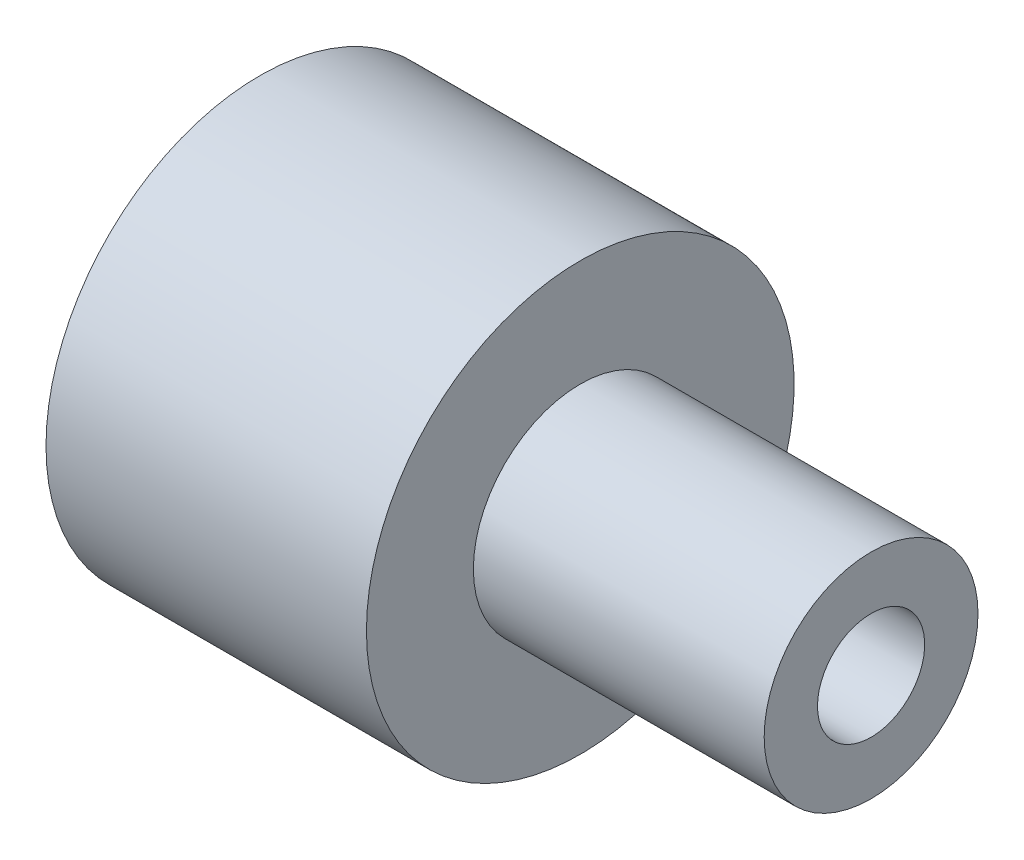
ISO-10303-21;
HEADER;
FILE_DESCRIPTION(('STEP AP214'),'2;1');
FILE_NAME('part.step','',(''),(''),'','','');
FILE_SCHEMA(('AUTOMOTIVE_DESIGN { 1 0 10303 214 1 1 1 1 }'));
ENDSEC;
DATA;
#1=APPLICATION_CONTEXT('core data for automotive mechanical design processes');
#2=APPLICATION_PROTOCOL_DEFINITION('international standard','automotive_design',2000,#1);
#3=PRODUCT_CONTEXT('',#1,'mechanical');
#4=PRODUCT('Part','Part','',(#3));
#5=PRODUCT_RELATED_PRODUCT_CATEGORY('part','',(#4));
#6=PRODUCT_DEFINITION_FORMATION('','',#4);
#7=PRODUCT_DEFINITION_CONTEXT('part definition',#1,'design');
#8=PRODUCT_DEFINITION('design','',#6,#7);
#9=PRODUCT_DEFINITION_SHAPE('','',#8);
#10=(LENGTH_UNIT() NAMED_UNIT(*) SI_UNIT(.MILLI.,.METRE.));
#11=(NAMED_UNIT(*) PLANE_ANGLE_UNIT() SI_UNIT($,.RADIAN.));
#12=(NAMED_UNIT(*) SI_UNIT($,.STERADIAN.) SOLID_ANGLE_UNIT());
#13=UNCERTAINTY_MEASURE_WITH_UNIT(LENGTH_MEASURE(1.E-05),#10,'distance_accuracy_value','');
#14=(GEOMETRIC_REPRESENTATION_CONTEXT(3) GLOBAL_UNCERTAINTY_ASSIGNED_CONTEXT((#13)) GLOBAL_UNIT_ASSIGNED_CONTEXT((#10,
#11,#12)) REPRESENTATION_CONTEXT('',''));
#15=CARTESIAN_POINT('',(0.,0.,0.));
#16=DIRECTION('',(0.,0.,1.));
#17=DIRECTION('',(1.,0.,0.));
#18=AXIS2_PLACEMENT_3D('',#15,#16,#17);
#19=CARTESIAN_POINT('',(12.192,0.,0.));
#20=DIRECTION('',(-1.,0.,0.));
#21=DIRECTION('',(0.,0.,1.));
#22=AXIS2_PLACEMENT_3D('',#19,#20,#21);
#23=CONICAL_SURFACE('',#22,3.9624,0.855211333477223);
#24=CARTESIAN_POINT('',(13.560952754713,0.,0.));
#25=DIRECTION('',(-1.,0.,0.));
#26=DIRECTION('',(0.,0.,1.));
#27=AXIS2_PLACEMENT_3D('',#24,#25,#26);
#28=CIRCLE('',#27,2.3876);
#29=CARTESIAN_POINT('',(13.560952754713,0.,2.3876));
#30=VERTEX_POINT('',#29);
#31=EDGE_CURVE('E12',#30,#30,#28,.T.);
#32=ORIENTED_EDGE('',*,*,#31,.F.);
#33=EDGE_LOOP('',(#32));
#34=FACE_BOUND('',#33,.T.);
#35=CARTESIAN_POINT('',(12.192,0.,0.));
#36=DIRECTION('',(-1.,0.,0.));
#37=DIRECTION('',(0.,0.,1.));
#38=AXIS2_PLACEMENT_3D('',#35,#36,#37);
#39=CIRCLE('',#38,3.9624);
#40=CARTESIAN_POINT('',(12.192,0.,3.9624));
#41=VERTEX_POINT('',#40);
#42=EDGE_CURVE('E71',#41,#41,#39,.T.);
#43=ORIENTED_EDGE('',*,*,#42,.T.);
#44=EDGE_LOOP('',(#43));
#45=FACE_BOUND('',#44,.T.);
#46=ADVANCED_FACE('F43',(#34,#45),#23,.F.);
#47=CARTESIAN_POINT('',(0.,0.,0.));
#48=DIRECTION('',(-1.,0.,0.));
#49=DIRECTION('',(0.,0.,1.));
#50=AXIS2_PLACEMENT_3D('',#47,#48,#49);
#51=CYLINDRICAL_SURFACE('',#50,2.3876);
#52=CARTESIAN_POINT('',(27.2288,0.,0.));
#53=DIRECTION('',(-1.,0.,0.));
#54=DIRECTION('',(0.,0.,1.));
#55=AXIS2_PLACEMENT_3D('',#52,#53,#54);
#56=CIRCLE('',#55,2.3876);
#57=CARTESIAN_POINT('',(27.2288,0.,2.3876));
#58=VERTEX_POINT('',#57);
#59=EDGE_CURVE('E49',#58,#58,#56,.T.);
#60=ORIENTED_EDGE('',*,*,#59,.F.);
#61=EDGE_LOOP('',(#60));
#62=FACE_BOUND('',#61,.T.);
#63=ORIENTED_EDGE('',*,*,#31,.T.);
#64=EDGE_LOOP('',(#63));
#65=FACE_BOUND('',#64,.T.);
#66=ADVANCED_FACE('F108',(#62,#65),#51,.F.);
#67=CARTESIAN_POINT('',(27.2288,4.7625,0.));
#68=DIRECTION('',(-1.,0.,0.));
#69=DIRECTION('',(0.,0.,1.));
#70=AXIS2_PLACEMENT_3D('',#67,#68,#69);
#71=PLANE('',#70);
#72=CARTESIAN_POINT('',(27.2288,0.,0.));
#73=DIRECTION('',(-1.,0.,0.));
#74=DIRECTION('',(0.,0.,1.));
#75=AXIS2_PLACEMENT_3D('',#72,#73,#74);
#76=CIRCLE('',#75,4.7625);
#77=CARTESIAN_POINT('',(27.2288,0.,4.7625));
#78=VERTEX_POINT('',#77);
#79=EDGE_CURVE('E53',#78,#78,#76,.T.);
#80=ORIENTED_EDGE('',*,*,#79,.F.);
#81=EDGE_LOOP('',(#80));
#82=FACE_BOUND('',#81,.T.);
#83=ORIENTED_EDGE('',*,*,#59,.T.);
#84=EDGE_LOOP('',(#83));
#85=FACE_BOUND('',#84,.T.);
#86=ADVANCED_FACE('F103',(#82,#85),#71,.F.);
#87=CARTESIAN_POINT('',(0.,0.,0.));
#88=DIRECTION('',(-1.,0.,0.));
#89=DIRECTION('',(0.,0.,1.));
#90=AXIS2_PLACEMENT_3D('',#87,#88,#89);
#91=CYLINDRICAL_SURFACE('',#90,4.7625);
#92=CARTESIAN_POINT('',(14.2748,0.,0.));
#93=DIRECTION('',(-1.,0.,0.));
#94=DIRECTION('',(0.,0.,1.));
#95=AXIS2_PLACEMENT_3D('',#92,#93,#94);
#96=CIRCLE('',#95,4.7625);
#97=CARTESIAN_POINT('',(14.2748,0.,4.7625));
#98=VERTEX_POINT('',#97);
#99=EDGE_CURVE('E57',#98,#98,#96,.T.);
#100=ORIENTED_EDGE('',*,*,#99,.F.);
#101=EDGE_LOOP('',(#100));
#102=FACE_BOUND('',#101,.T.);
#103=ORIENTED_EDGE('',*,*,#79,.T.);
#104=EDGE_LOOP('',(#103));
#105=FACE_BOUND('',#104,.T.);
#106=ADVANCED_FACE('F97',(#102,#105),#91,.T.);
#107=CARTESIAN_POINT('',(14.2748,9.525,0.));
#108=DIRECTION('',(-1.,0.,0.));
#109=DIRECTION('',(0.,0.,1.));
#110=AXIS2_PLACEMENT_3D('',#107,#108,#109);
#111=PLANE('',#110);
#112=CARTESIAN_POINT('',(14.2748,0.,0.));
#113=DIRECTION('',(-1.,0.,0.));
#114=DIRECTION('',(0.,0.,1.));
#115=AXIS2_PLACEMENT_3D('',#112,#113,#114);
#116=CIRCLE('',#115,9.525);
#117=CARTESIAN_POINT('',(14.2748,0.,9.525));
#118=VERTEX_POINT('',#117);
#119=EDGE_CURVE('E62',#118,#118,#116,.T.);
#120=ORIENTED_EDGE('',*,*,#119,.F.);
#121=EDGE_LOOP('',(#120));
#122=FACE_BOUND('',#121,.T.);
#123=ORIENTED_EDGE('',*,*,#99,.T.);
#124=EDGE_LOOP('',(#123));
#125=FACE_BOUND('',#124,.T.);
#126=ADVANCED_FACE('F91',(#122,#125),#111,.F.);
#127=CARTESIAN_POINT('',(0.,0.,0.));
#128=DIRECTION('',(-1.,0.,0.));
#129=DIRECTION('',(0.,0.,1.));
#130=AXIS2_PLACEMENT_3D('',#127,#128,#129);
#131=CYLINDRICAL_SURFACE('',#130,9.525);
#132=CARTESIAN_POINT('',(0.,0.,0.));
#133=DIRECTION('',(-1.,0.,0.));
#134=DIRECTION('',(0.,0.,1.));
#135=AXIS2_PLACEMENT_3D('',#132,#133,#134);
#136=CIRCLE('',#135,9.525);
#137=CARTESIAN_POINT('',(0.,0.,9.525));
#138=VERTEX_POINT('',#137);
#139=EDGE_CURVE('E65',#138,#138,#136,.T.);
#140=ORIENTED_EDGE('',*,*,#139,.F.);
#141=EDGE_LOOP('',(#140));
#142=FACE_BOUND('',#141,.T.);
#143=ORIENTED_EDGE('',*,*,#119,.T.);
#144=EDGE_LOOP('',(#143));
#145=FACE_BOUND('',#144,.T.);
#146=ADVANCED_FACE('F85',(#142,#145),#131,.T.);
#147=CARTESIAN_POINT('',(0.,3.9624,0.));
#148=DIRECTION('',(1.,0.,0.));
#149=DIRECTION('',(0.,0.,-1.));
#150=AXIS2_PLACEMENT_3D('',#147,#148,#149);
#151=PLANE('',#150);
#152=CARTESIAN_POINT('',(0.,0.,0.));
#153=DIRECTION('',(-1.,0.,0.));
#154=DIRECTION('',(0.,0.,1.));
#155=AXIS2_PLACEMENT_3D('',#152,#153,#154);
#156=CIRCLE('',#155,3.9624);
#157=CARTESIAN_POINT('',(0.,0.,3.9624));
#158=VERTEX_POINT('',#157);
#159=EDGE_CURVE('E68',#158,#158,#156,.T.);
#160=ORIENTED_EDGE('',*,*,#159,.F.);
#161=EDGE_LOOP('',(#160));
#162=FACE_BOUND('',#161,.T.);
#163=ORIENTED_EDGE('',*,*,#139,.T.);
#164=EDGE_LOOP('',(#163));
#165=FACE_BOUND('',#164,.T.);
#166=ADVANCED_FACE('F79',(#162,#165),#151,.F.);
#167=CARTESIAN_POINT('',(0.,0.,0.));
#168=DIRECTION('',(-1.,0.,0.));
#169=DIRECTION('',(0.,0.,1.));
#170=AXIS2_PLACEMENT_3D('',#167,#168,#169);
#171=CYLINDRICAL_SURFACE('',#170,3.9624);
#172=ORIENTED_EDGE('',*,*,#42,.F.);
#173=EDGE_LOOP('',(#172));
#174=FACE_BOUND('',#173,.T.);
#175=ORIENTED_EDGE('',*,*,#159,.T.);
#176=EDGE_LOOP('',(#175));
#177=FACE_BOUND('',#176,.T.);
#178=ADVANCED_FACE('F76',(#174,#177),#171,.F.);
#179=CLOSED_SHELL('',(#46,#66,#86,#106,#126,#146,#166,#178));
#180=MANIFOLD_SOLID_BREP('B2',#179);
#181=ADVANCED_BREP_SHAPE_REPRESENTATION('',(#18,#180),#14);
#182=SHAPE_DEFINITION_REPRESENTATION(#9,#181);
ENDSEC;
END-ISO-10303-21;
